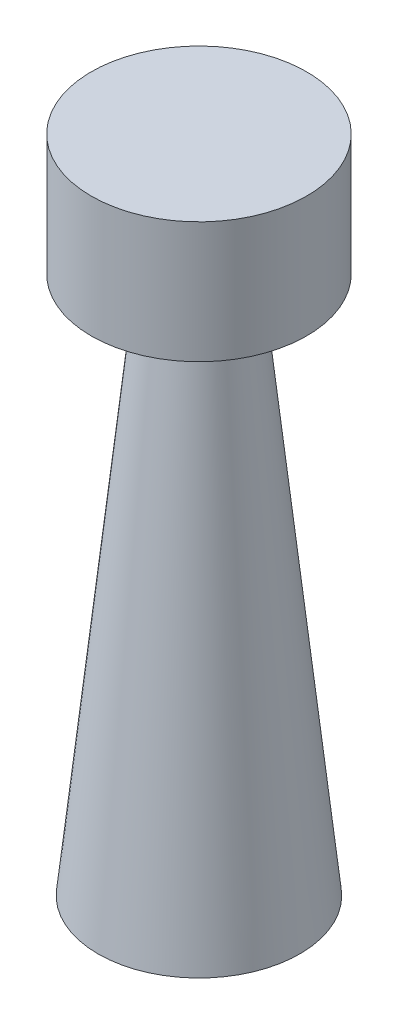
ISO-10303-21;
HEADER;
FILE_DESCRIPTION(('STEP AP214'),'2;1');
FILE_NAME('part.step','',(''),(''),'','','');
FILE_SCHEMA(('AUTOMOTIVE_DESIGN { 1 0 10303 214 1 1 1 1 }'));
ENDSEC;
DATA;
#1=APPLICATION_CONTEXT('core data for automotive mechanical design processes');
#2=APPLICATION_PROTOCOL_DEFINITION('international standard','automotive_design',2000,#1);
#3=PRODUCT_CONTEXT('',#1,'mechanical');
#4=PRODUCT('Part','Part','',(#3));
#5=PRODUCT_RELATED_PRODUCT_CATEGORY('part','',(#4));
#6=PRODUCT_DEFINITION_FORMATION('','',#4);
#7=PRODUCT_DEFINITION_CONTEXT('part definition',#1,'design');
#8=PRODUCT_DEFINITION('design','',#6,#7);
#9=PRODUCT_DEFINITION_SHAPE('','',#8);
#10=(LENGTH_UNIT() NAMED_UNIT(*) SI_UNIT(.MILLI.,.METRE.));
#11=(NAMED_UNIT(*) PLANE_ANGLE_UNIT() SI_UNIT($,.RADIAN.));
#12=(NAMED_UNIT(*) SI_UNIT($,.STERADIAN.) SOLID_ANGLE_UNIT());
#13=UNCERTAINTY_MEASURE_WITH_UNIT(LENGTH_MEASURE(1.E-05),#10,'distance_accuracy_value','');
#14=(GEOMETRIC_REPRESENTATION_CONTEXT(3) GLOBAL_UNCERTAINTY_ASSIGNED_CONTEXT((#13)) GLOBAL_UNIT_ASSIGNED_CONTEXT((#10,
#11,#12)) REPRESENTATION_CONTEXT('',''));
#15=CARTESIAN_POINT('',(0.,0.,0.));
#16=DIRECTION('',(0.,0.,1.));
#17=DIRECTION('',(1.,0.,0.));
#18=AXIS2_PLACEMENT_3D('',#15,#16,#17);
#19=CARTESIAN_POINT('',(0.,0.,0.));
#20=DIRECTION('',(0.,-1.,0.));
#21=DIRECTION('',(0.,0.,1.));
#22=AXIS2_PLACEMENT_3D('',#19,#20,#21);
#23=CONICAL_SURFACE('',#22,375.,0.10471975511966);
#24=CARTESIAN_POINT('',(0.,2000.,0.));
#25=DIRECTION('',(0.,1.,0.));
#26=DIRECTION('',(0.,0.,1.));
#27=AXIS2_PLACEMENT_3D('',#24,#25,#26);
#28=CIRCLE('',#27,164.791529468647);
#29=CARTESIAN_POINT('',(0.,2000.,164.791529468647));
#30=VERTEX_POINT('',#29);
#31=EDGE_CURVE('E10',#30,#30,#28,.T.);
#32=ORIENTED_EDGE('',*,*,#31,.F.);
#33=EDGE_LOOP('',(#32));
#34=FACE_BOUND('',#33,.T.);
#35=CARTESIAN_POINT('',(0.,0.,0.));
#36=DIRECTION('',(0.,1.,0.));
#37=DIRECTION('',(0.,0.,1.));
#38=AXIS2_PLACEMENT_3D('',#35,#36,#37);
#39=CIRCLE('',#38,375.);
#40=CARTESIAN_POINT('',(0.,0.,375.));
#41=VERTEX_POINT('',#40);
#42=EDGE_CURVE('E36',#41,#41,#39,.T.);
#43=ORIENTED_EDGE('',*,*,#42,.T.);
#44=EDGE_LOOP('',(#43));
#45=FACE_BOUND('',#44,.T.);
#46=ADVANCED_FACE('F30',(#34,#45),#23,.T.);
#47=CARTESIAN_POINT('',(0.,0.,0.));
#48=DIRECTION('',(0.,1.,0.));
#49=DIRECTION('',(0.,0.,1.));
#50=AXIS2_PLACEMENT_3D('',#47,#48,#49);
#51=PLANE('',#50);
#52=ORIENTED_EDGE('',*,*,#42,.F.);
#53=EDGE_LOOP('',(#52));
#54=FACE_BOUND('',#53,.T.);
#55=ADVANCED_FACE('F63',(#54),#51,.F.);
#56=CARTESIAN_POINT('',(0.,2450.,0.));
#57=DIRECTION('',(0.,-1.,0.));
#58=DIRECTION('',(0.,0.,-1.));
#59=AXIS2_PLACEMENT_3D('',#56,#57,#58);
#60=CYLINDRICAL_SURFACE('',#59,400.);
#61=CARTESIAN_POINT('',(0.,2450.,0.));
#62=DIRECTION('',(0.,1.,0.));
#63=DIRECTION('',(0.,0.,1.));
#64=AXIS2_PLACEMENT_3D('',#61,#62,#63);
#65=CIRCLE('',#64,400.);
#66=CARTESIAN_POINT('',(0.,2450.,400.));
#67=VERTEX_POINT('',#66);
#68=EDGE_CURVE('E40',#67,#67,#65,.T.);
#69=ORIENTED_EDGE('',*,*,#68,.F.);
#70=EDGE_LOOP('',(#69));
#71=FACE_BOUND('',#70,.T.);
#72=CARTESIAN_POINT('',(0.,2000.,0.));
#73=DIRECTION('',(0.,1.,0.));
#74=DIRECTION('',(0.,0.,1.));
#75=AXIS2_PLACEMENT_3D('',#72,#73,#74);
#76=CIRCLE('',#75,400.);
#77=CARTESIAN_POINT('',(0.,2000.,400.));
#78=VERTEX_POINT('',#77);
#79=EDGE_CURVE('E44',#78,#78,#76,.T.);
#80=ORIENTED_EDGE('',*,*,#79,.T.);
#81=EDGE_LOOP('',(#80));
#82=FACE_BOUND('',#81,.T.);
#83=ADVANCED_FACE('F50',(#71,#82),#60,.T.);
#84=CARTESIAN_POINT('',(0.,2450.,0.));
#85=DIRECTION('',(0.,1.,0.));
#86=DIRECTION('',(0.,0.,1.));
#87=AXIS2_PLACEMENT_3D('',#84,#85,#86);
#88=PLANE('',#87);
#89=ORIENTED_EDGE('',*,*,#68,.T.);
#90=EDGE_LOOP('',(#89));
#91=FACE_BOUND('',#90,.T.);
#92=ADVANCED_FACE('F54',(#91),#88,.T.);
#93=CARTESIAN_POINT('',(0.,2000.,0.));
#94=DIRECTION('',(0.,1.,0.));
#95=DIRECTION('',(0.,0.,1.));
#96=AXIS2_PLACEMENT_3D('',#93,#94,#95);
#97=PLANE('',#96);
#98=ORIENTED_EDGE('',*,*,#31,.T.);
#99=EDGE_LOOP('',(#98));
#100=FACE_BOUND('',#99,.T.);
#101=ORIENTED_EDGE('',*,*,#79,.F.);
#102=EDGE_LOOP('',(#101));
#103=FACE_BOUND('',#102,.T.);
#104=ADVANCED_FACE('F52',(#100,#103),#97,.F.);
#105=CLOSED_SHELL('',(#46,#55,#83,#92,#104));
#106=MANIFOLD_SOLID_BREP('B2',#105);
#107=ADVANCED_BREP_SHAPE_REPRESENTATION('',(#18,#106),#14);
#108=SHAPE_DEFINITION_REPRESENTATION(#9,#107);
ENDSEC;
END-ISO-10303-21;
